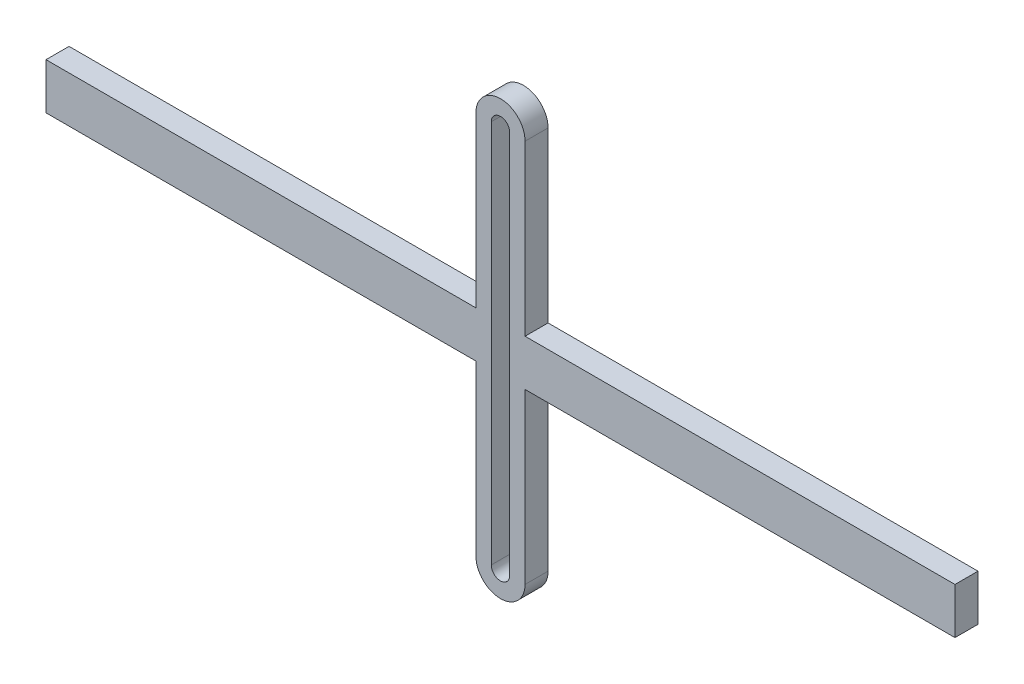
from build123d import *

# Parameters (mm, degrees)
BOSS_EXTRUDE1_DEPTH = 7.5
SKETCH5_W           = 7.5
SKETCH5_H           = 15
BOSS_EXTRUDE3_DEPTH = 140


with BuildPart() as part:
    # Sketch2 → Boss-Extrude1 (new body)
    with BuildSketch(Plane.XY):
        with BuildLine():
            Line((-8, -62.5), (-8, 62.5))
            ThreePointArc((-8, 62.5), (0, 70.5), (8, 62.5))
            Line((8, 62.5), (8, -62.5))
            ThreePointArc((8, -62.5), (0, -70.5), (-8, -62.5))
        make_face()
        with BuildLine():
            Line((-3, -62.5), (-3, 62.5))
            ThreePointArc((-3, 62.5), (0, 65.5), (3, 62.5))
            Line((3, 62.5), (3, -62.5))
            ThreePointArc((3, -62.5), (0, -65.5), (-3, -62.5))
        make_face(mode=Mode.SUBTRACT)
    extrude(amount=BOSS_EXTRUDE1_DEPTH)

    # Sketch5 → Boss-Extrude3 (add)
    with BuildSketch(Plane(origin=(8, 0, 0), x_dir=(0, 0, -1), z_dir=(1, 0, 0))):
        with Locations((-3.75, 0)):
            Rectangle(SKETCH5_W, SKETCH5_H)
    boss_extrude3 = extrude(amount=BOSS_EXTRUDE3_DEPTH)

    # Mirror1: Boss-Extrude3 across plane
    add(boss_extrude3.mirror(Plane(origin=(0, 0, 0), x_dir=(0, 0, 1), z_dir=(1, 0, 0))))


solid = part.part
